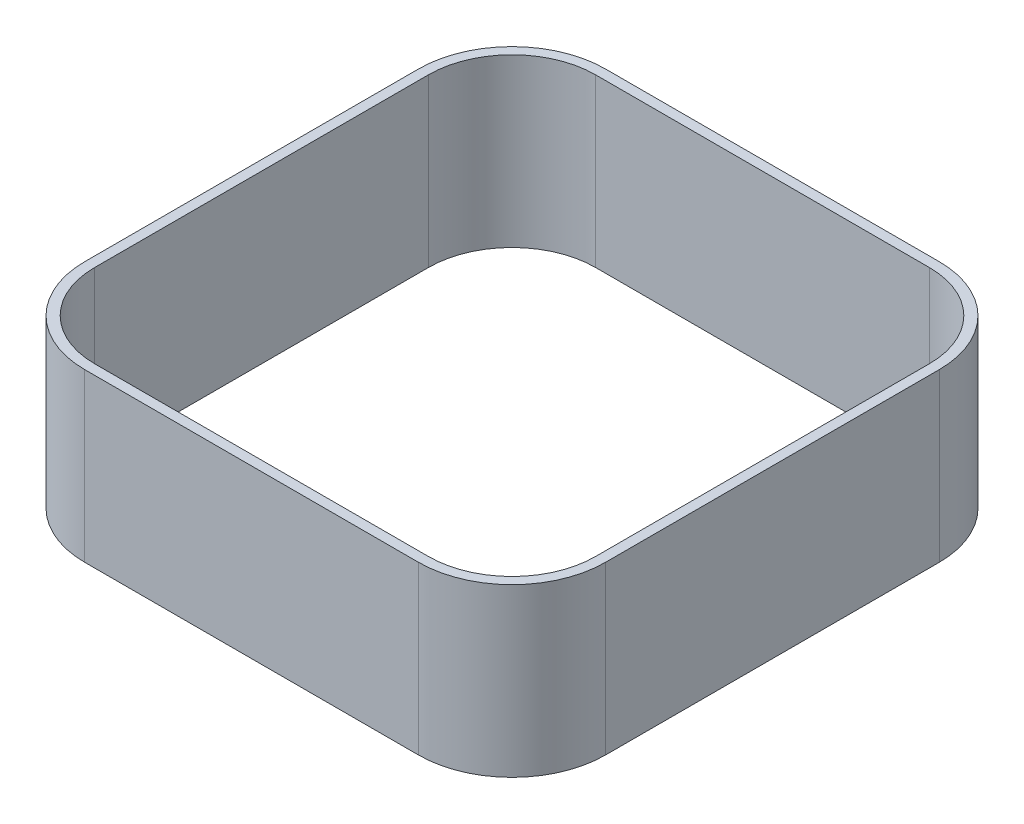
ISO-10303-21;
HEADER;
FILE_DESCRIPTION(('STEP AP214'),'2;1');
FILE_NAME('part.step','',(''),(''),'','','');
FILE_SCHEMA(('AUTOMOTIVE_DESIGN { 1 0 10303 214 1 1 1 1 }'));
ENDSEC;
DATA;
#1=APPLICATION_CONTEXT('core data for automotive mechanical design processes');
#2=APPLICATION_PROTOCOL_DEFINITION('international standard','automotive_design',2000,#1);
#3=PRODUCT_CONTEXT('',#1,'mechanical');
#4=PRODUCT('Part','Part','',(#3));
#5=PRODUCT_RELATED_PRODUCT_CATEGORY('part','',(#4));
#6=PRODUCT_DEFINITION_FORMATION('','',#4);
#7=PRODUCT_DEFINITION_CONTEXT('part definition',#1,'design');
#8=PRODUCT_DEFINITION('design','',#6,#7);
#9=PRODUCT_DEFINITION_SHAPE('','',#8);
#10=(LENGTH_UNIT() NAMED_UNIT(*) SI_UNIT(.MILLI.,.METRE.));
#11=(NAMED_UNIT(*) PLANE_ANGLE_UNIT() SI_UNIT($,.RADIAN.));
#12=(NAMED_UNIT(*) SI_UNIT($,.STERADIAN.) SOLID_ANGLE_UNIT());
#13=UNCERTAINTY_MEASURE_WITH_UNIT(LENGTH_MEASURE(1.E-05),#10,'distance_accuracy_value','');
#14=(GEOMETRIC_REPRESENTATION_CONTEXT(3) GLOBAL_UNCERTAINTY_ASSIGNED_CONTEXT((#13)) GLOBAL_UNIT_ASSIGNED_CONTEXT((#10,
#11,#12)) REPRESENTATION_CONTEXT('',''));
#15=CARTESIAN_POINT('',(0.,0.,0.));
#16=DIRECTION('',(0.,0.,1.));
#17=DIRECTION('',(1.,0.,0.));
#18=AXIS2_PLACEMENT_3D('',#15,#16,#17);
#19=CARTESIAN_POINT('',(-10.,10.,10.));
#20=DIRECTION('',(0.,-1.,0.));
#21=DIRECTION('',(0.,0.,-1.));
#22=AXIS2_PLACEMENT_3D('',#19,#20,#21);
#23=PLANE('',#22);
#24=CARTESIAN_POINT('',(-10.,10.,10.));
#25=DIRECTION('',(0.,1.,0.));
#26=DIRECTION('',(0.,0.,-1.));
#27=AXIS2_PLACEMENT_3D('',#24,#25,#26);
#28=CIRCLE('',#27,5.6);
#29=CARTESIAN_POINT('',(-15.6,10.,10.));
#30=VERTEX_POINT('',#29);
#31=CARTESIAN_POINT('',(-10.,10.,15.6));
#32=VERTEX_POINT('',#31);
#33=EDGE_CURVE('E211',#30,#32,#28,.T.);
#34=ORIENTED_EDGE('',*,*,#33,.T.);
#35=DIRECTION('',(1.,0.,0.));
#36=VECTOR('',#35,1.);
#37=CARTESIAN_POINT('',(-10.,10.,15.6));
#38=LINE('',#37,#36);
#39=CARTESIAN_POINT('',(10.,10.,15.6));
#40=VERTEX_POINT('',#39);
#41=EDGE_CURVE('E214',#32,#40,#38,.T.);
#42=ORIENTED_EDGE('',*,*,#41,.T.);
#43=CARTESIAN_POINT('',(10.,10.,10.));
#44=DIRECTION('',(0.,1.,0.));
#45=DIRECTION('',(0.,0.,1.));
#46=AXIS2_PLACEMENT_3D('',#43,#44,#45);
#47=CIRCLE('',#46,5.6);
#48=CARTESIAN_POINT('',(15.6,10.,10.));
#49=VERTEX_POINT('',#48);
#50=EDGE_CURVE('E217',#40,#49,#47,.T.);
#51=ORIENTED_EDGE('',*,*,#50,.T.);
#52=DIRECTION('',(0.,0.,-1.));
#53=VECTOR('',#52,1.);
#54=CARTESIAN_POINT('',(15.6,10.,10.));
#55=LINE('',#54,#53);
#56=CARTESIAN_POINT('',(15.6,10.,-10.));
#57=VERTEX_POINT('',#56);
#58=EDGE_CURVE('E219',#49,#57,#55,.T.);
#59=ORIENTED_EDGE('',*,*,#58,.T.);
#60=CARTESIAN_POINT('',(10.,10.,-10.));
#61=DIRECTION('',(0.,1.,0.));
#62=DIRECTION('',(0.,0.,-1.));
#63=AXIS2_PLACEMENT_3D('',#60,#61,#62);
#64=CIRCLE('',#63,5.6);
#65=CARTESIAN_POINT('',(10.,10.,-15.6));
#66=VERTEX_POINT('',#65);
#67=EDGE_CURVE('E221',#57,#66,#64,.T.);
#68=ORIENTED_EDGE('',*,*,#67,.T.);
#69=DIRECTION('',(-1.,0.,0.));
#70=VECTOR('',#69,1.);
#71=CARTESIAN_POINT('',(-10.,10.,-15.6));
#72=LINE('',#71,#70);
#73=CARTESIAN_POINT('',(-10.,10.,-15.6));
#74=VERTEX_POINT('',#73);
#75=EDGE_CURVE('E223',#66,#74,#72,.T.);
#76=ORIENTED_EDGE('',*,*,#75,.T.);
#77=CARTESIAN_POINT('',(-10.,10.,-10.));
#78=DIRECTION('',(0.,1.,0.));
#79=DIRECTION('',(0.,0.,-1.));
#80=AXIS2_PLACEMENT_3D('',#77,#78,#79);
#81=CIRCLE('',#80,5.6);
#82=CARTESIAN_POINT('',(-15.6,10.,-10.));
#83=VERTEX_POINT('',#82);
#84=EDGE_CURVE('E225',#74,#83,#81,.T.);
#85=ORIENTED_EDGE('',*,*,#84,.T.);
#86=DIRECTION('',(0.,0.,1.));
#87=VECTOR('',#86,1.);
#88=CARTESIAN_POINT('',(-15.6,10.,10.));
#89=LINE('',#88,#87);
#90=EDGE_CURVE('E227',#83,#30,#89,.T.);
#91=ORIENTED_EDGE('',*,*,#90,.T.);
#92=EDGE_LOOP('',(#34,#42,#51,#59,#68,#76,#85,#91));
#93=FACE_BOUND('',#92,.T.);
#94=CARTESIAN_POINT('',(-10.,10.,10.));
#95=DIRECTION('',(0.,1.,0.));
#96=DIRECTION('',(0.,0.,-1.));
#97=AXIS2_PLACEMENT_3D('',#94,#95,#96);
#98=CIRCLE('',#97,5.);
#99=CARTESIAN_POINT('',(-15.,10.,10.));
#100=VERTEX_POINT('',#99);
#101=CARTESIAN_POINT('',(-10.,10.,15.));
#102=VERTEX_POINT('',#101);
#103=EDGE_CURVE('E146',#100,#102,#98,.T.);
#104=ORIENTED_EDGE('',*,*,#103,.F.);
#105=DIRECTION('',(0.,0.,1.));
#106=VECTOR('',#105,1.);
#107=CARTESIAN_POINT('',(-15.,10.,10.));
#108=LINE('',#107,#106);
#109=CARTESIAN_POINT('',(-15.,10.,-10.));
#110=VERTEX_POINT('',#109);
#111=EDGE_CURVE('E179',#110,#100,#108,.T.);
#112=ORIENTED_EDGE('',*,*,#111,.F.);
#113=CARTESIAN_POINT('',(-10.,10.,-10.));
#114=DIRECTION('',(0.,1.,0.));
#115=DIRECTION('',(0.,0.,-1.));
#116=AXIS2_PLACEMENT_3D('',#113,#114,#115);
#117=CIRCLE('',#116,5.);
#118=CARTESIAN_POINT('',(-10.,10.,-15.));
#119=VERTEX_POINT('',#118);
#120=EDGE_CURVE('E177',#119,#110,#117,.T.);
#121=ORIENTED_EDGE('',*,*,#120,.F.);
#122=DIRECTION('',(-1.,0.,0.));
#123=VECTOR('',#122,1.);
#124=CARTESIAN_POINT('',(-10.,10.,-15.));
#125=LINE('',#124,#123);
#126=CARTESIAN_POINT('',(10.,10.,-15.));
#127=VERTEX_POINT('',#126);
#128=EDGE_CURVE('E175',#127,#119,#125,.T.);
#129=ORIENTED_EDGE('',*,*,#128,.F.);
#130=CARTESIAN_POINT('',(10.,10.,-10.));
#131=DIRECTION('',(0.,1.,0.));
#132=DIRECTION('',(0.,0.,-1.));
#133=AXIS2_PLACEMENT_3D('',#130,#131,#132);
#134=CIRCLE('',#133,5.);
#135=CARTESIAN_POINT('',(15.,10.,-10.));
#136=VERTEX_POINT('',#135);
#137=EDGE_CURVE('E173',#136,#127,#134,.T.);
#138=ORIENTED_EDGE('',*,*,#137,.F.);
#139=DIRECTION('',(0.,0.,-1.));
#140=VECTOR('',#139,1.);
#141=CARTESIAN_POINT('',(15.,10.,10.));
#142=LINE('',#141,#140);
#143=CARTESIAN_POINT('',(15.,10.,10.));
#144=VERTEX_POINT('',#143);
#145=EDGE_CURVE('E169',#144,#136,#142,.T.);
#146=ORIENTED_EDGE('',*,*,#145,.F.);
#147=CARTESIAN_POINT('',(10.,10.,10.));
#148=DIRECTION('',(0.,1.,0.));
#149=DIRECTION('',(0.,0.,1.));
#150=AXIS2_PLACEMENT_3D('',#147,#148,#149);
#151=CIRCLE('',#150,5.);
#152=CARTESIAN_POINT('',(10.,10.,15.));
#153=VERTEX_POINT('',#152);
#154=EDGE_CURVE('E167',#153,#144,#151,.T.);
#155=ORIENTED_EDGE('',*,*,#154,.F.);
#156=DIRECTION('',(1.,0.,0.));
#157=VECTOR('',#156,1.);
#158=CARTESIAN_POINT('',(-10.,10.,15.));
#159=LINE('',#158,#157);
#160=EDGE_CURVE('E154',#102,#153,#159,.T.);
#161=ORIENTED_EDGE('',*,*,#160,.F.);
#162=EDGE_LOOP('',(#104,#112,#121,#129,#138,#146,#155,#161));
#163=FACE_BOUND('',#162,.T.);
#164=ADVANCED_FACE('F33',(#93,#163),#23,.F.);
#165=CARTESIAN_POINT('',(-10.,0.,10.));
#166=DIRECTION('',(0.,-1.,0.));
#167=DIRECTION('',(0.,0.,-1.));
#168=AXIS2_PLACEMENT_3D('',#165,#166,#167);
#169=PLANE('',#168);
#170=CARTESIAN_POINT('',(-10.,0.,10.));
#171=DIRECTION('',(0.,1.,0.));
#172=DIRECTION('',(0.,0.,-1.));
#173=AXIS2_PLACEMENT_3D('',#170,#171,#172);
#174=CIRCLE('',#173,5.6);
#175=CARTESIAN_POINT('',(-15.6,0.,10.));
#176=VERTEX_POINT('',#175);
#177=CARTESIAN_POINT('',(-10.,0.,15.6));
#178=VERTEX_POINT('',#177);
#179=EDGE_CURVE('E162',#176,#178,#174,.T.);
#180=ORIENTED_EDGE('',*,*,#179,.F.);
#181=DIRECTION('',(0.,0.,1.));
#182=VECTOR('',#181,1.);
#183=CARTESIAN_POINT('',(-15.6,0.,10.));
#184=LINE('',#183,#182);
#185=CARTESIAN_POINT('',(-15.6,0.,-10.));
#186=VERTEX_POINT('',#185);
#187=EDGE_CURVE('E215',#186,#176,#184,.T.);
#188=ORIENTED_EDGE('',*,*,#187,.F.);
#189=CARTESIAN_POINT('',(-10.,0.,-10.));
#190=DIRECTION('',(0.,1.,0.));
#191=DIRECTION('',(0.,0.,-1.));
#192=AXIS2_PLACEMENT_3D('',#189,#190,#191);
#193=CIRCLE('',#192,5.6);
#194=CARTESIAN_POINT('',(-10.,0.,-15.6));
#195=VERTEX_POINT('',#194);
#196=EDGE_CURVE('E242',#195,#186,#193,.T.);
#197=ORIENTED_EDGE('',*,*,#196,.F.);
#198=DIRECTION('',(-1.,0.,0.));
#199=VECTOR('',#198,1.);
#200=CARTESIAN_POINT('',(-10.,0.,-15.6));
#201=LINE('',#200,#199);
#202=CARTESIAN_POINT('',(10.,0.,-15.6));
#203=VERTEX_POINT('',#202);
#204=EDGE_CURVE('E240',#203,#195,#201,.T.);
#205=ORIENTED_EDGE('',*,*,#204,.F.);
#206=CARTESIAN_POINT('',(10.,0.,-10.));
#207=DIRECTION('',(0.,1.,0.));
#208=DIRECTION('',(0.,0.,-1.));
#209=AXIS2_PLACEMENT_3D('',#206,#207,#208);
#210=CIRCLE('',#209,5.6);
#211=CARTESIAN_POINT('',(15.6,0.,-10.));
#212=VERTEX_POINT('',#211);
#213=EDGE_CURVE('E238',#212,#203,#210,.T.);
#214=ORIENTED_EDGE('',*,*,#213,.F.);
#215=DIRECTION('',(0.,0.,-1.));
#216=VECTOR('',#215,1.);
#217=CARTESIAN_POINT('',(15.6,0.,10.));
#218=LINE('',#217,#216);
#219=CARTESIAN_POINT('',(15.6,0.,10.));
#220=VERTEX_POINT('',#219);
#221=EDGE_CURVE('E236',#220,#212,#218,.T.);
#222=ORIENTED_EDGE('',*,*,#221,.F.);
#223=CARTESIAN_POINT('',(10.,0.,10.));
#224=DIRECTION('',(0.,1.,0.));
#225=DIRECTION('',(0.,0.,1.));
#226=AXIS2_PLACEMENT_3D('',#223,#224,#225);
#227=CIRCLE('',#226,5.6);
#228=CARTESIAN_POINT('',(10.,0.,15.6));
#229=VERTEX_POINT('',#228);
#230=EDGE_CURVE('E234',#229,#220,#227,.T.);
#231=ORIENTED_EDGE('',*,*,#230,.F.);
#232=DIRECTION('',(1.,0.,0.));
#233=VECTOR('',#232,1.);
#234=CARTESIAN_POINT('',(-10.,0.,15.6));
#235=LINE('',#234,#233);
#236=EDGE_CURVE('E232',#178,#229,#235,.T.);
#237=ORIENTED_EDGE('',*,*,#236,.F.);
#238=EDGE_LOOP('',(#180,#188,#197,#205,#214,#222,#231,#237));
#239=FACE_BOUND('',#238,.T.);
#240=DIRECTION('',(0.,0.,1.));
#241=VECTOR('',#240,1.);
#242=CARTESIAN_POINT('',(-15.,0.,10.));
#243=LINE('',#242,#241);
#244=CARTESIAN_POINT('',(-15.,0.,-10.));
#245=VERTEX_POINT('',#244);
#246=CARTESIAN_POINT('',(-15.,0.,10.));
#247=VERTEX_POINT('',#246);
#248=EDGE_CURVE('E155',#245,#247,#243,.T.);
#249=ORIENTED_EDGE('',*,*,#248,.T.);
#250=CARTESIAN_POINT('',(-10.,0.,10.));
#251=DIRECTION('',(0.,1.,0.));
#252=DIRECTION('',(0.,0.,-1.));
#253=AXIS2_PLACEMENT_3D('',#250,#251,#252);
#254=CIRCLE('',#253,5.);
#255=CARTESIAN_POINT('',(-10.,0.,15.));
#256=VERTEX_POINT('',#255);
#257=EDGE_CURVE('E56',#247,#256,#254,.T.);
#258=ORIENTED_EDGE('',*,*,#257,.T.);
#259=DIRECTION('',(1.,0.,0.));
#260=VECTOR('',#259,1.);
#261=CARTESIAN_POINT('',(-10.,0.,15.));
#262=LINE('',#261,#260);
#263=CARTESIAN_POINT('',(10.,0.,15.));
#264=VERTEX_POINT('',#263);
#265=EDGE_CURVE('E161',#256,#264,#262,.T.);
#266=ORIENTED_EDGE('',*,*,#265,.T.);
#267=CARTESIAN_POINT('',(10.,0.,10.));
#268=DIRECTION('',(0.,1.,0.));
#269=DIRECTION('',(0.,0.,1.));
#270=AXIS2_PLACEMENT_3D('',#267,#268,#269);
#271=CIRCLE('',#270,5.);
#272=CARTESIAN_POINT('',(15.,0.,10.));
#273=VERTEX_POINT('',#272);
#274=EDGE_CURVE('E183',#264,#273,#271,.T.);
#275=ORIENTED_EDGE('',*,*,#274,.T.);
#276=DIRECTION('',(0.,0.,-1.));
#277=VECTOR('',#276,1.);
#278=CARTESIAN_POINT('',(15.,0.,10.));
#279=LINE('',#278,#277);
#280=CARTESIAN_POINT('',(15.,0.,-10.));
#281=VERTEX_POINT('',#280);
#282=EDGE_CURVE('E186',#273,#281,#279,.T.);
#283=ORIENTED_EDGE('',*,*,#282,.T.);
#284=CARTESIAN_POINT('',(10.,0.,-10.));
#285=DIRECTION('',(0.,1.,0.));
#286=DIRECTION('',(0.,0.,-1.));
#287=AXIS2_PLACEMENT_3D('',#284,#285,#286);
#288=CIRCLE('',#287,5.);
#289=CARTESIAN_POINT('',(10.,0.,-15.));
#290=VERTEX_POINT('',#289);
#291=EDGE_CURVE('E189',#281,#290,#288,.T.);
#292=ORIENTED_EDGE('',*,*,#291,.T.);
#293=DIRECTION('',(-1.,0.,0.));
#294=VECTOR('',#293,1.);
#295=CARTESIAN_POINT('',(-10.,0.,-15.));
#296=LINE('',#295,#294);
#297=CARTESIAN_POINT('',(-10.,0.,-15.));
#298=VERTEX_POINT('',#297);
#299=EDGE_CURVE('E192',#290,#298,#296,.T.);
#300=ORIENTED_EDGE('',*,*,#299,.T.);
#301=CARTESIAN_POINT('',(-10.,0.,-10.));
#302=DIRECTION('',(0.,1.,0.));
#303=DIRECTION('',(0.,0.,-1.));
#304=AXIS2_PLACEMENT_3D('',#301,#302,#303);
#305=CIRCLE('',#304,5.);
#306=EDGE_CURVE('E195',#298,#245,#305,.T.);
#307=ORIENTED_EDGE('',*,*,#306,.T.);
#308=EDGE_LOOP('',(#249,#258,#266,#275,#283,#292,#300,#307));
#309=FACE_BOUND('',#308,.T.);
#310=ADVANCED_FACE('F272',(#239,#309),#169,.T.);
#311=CARTESIAN_POINT('',(-10.,10.,10.));
#312=DIRECTION('',(0.,-1.,0.));
#313=DIRECTION('',(0.,0.,-1.));
#314=AXIS2_PLACEMENT_3D('',#311,#312,#313);
#315=CYLINDRICAL_SURFACE('',#314,5.6);
#316=ORIENTED_EDGE('',*,*,#179,.T.);
#317=DIRECTION('',(0.,-1.,0.));
#318=VECTOR('',#317,1.);
#319=CARTESIAN_POINT('',(-10.,10.,15.6));
#320=LINE('',#319,#318);
#321=EDGE_CURVE('E11',#32,#178,#320,.T.);
#322=ORIENTED_EDGE('',*,*,#321,.F.);
#323=ORIENTED_EDGE('',*,*,#33,.F.);
#324=DIRECTION('',(0.,-1.,0.));
#325=VECTOR('',#324,1.);
#326=CARTESIAN_POINT('',(-15.6,10.,10.));
#327=LINE('',#326,#325);
#328=EDGE_CURVE('E229',#30,#176,#327,.T.);
#329=ORIENTED_EDGE('',*,*,#328,.T.);
#330=EDGE_LOOP('',(#316,#322,#323,#329));
#331=FACE_BOUND('',#330,.T.);
#332=ADVANCED_FACE('F35',(#331),#315,.T.);
#333=CARTESIAN_POINT('',(-10.,10.,15.6));
#334=DIRECTION('',(0.,0.,-1.));
#335=DIRECTION('',(-1.,0.,0.));
#336=AXIS2_PLACEMENT_3D('',#333,#334,#335);
#337=PLANE('',#336);
#338=ORIENTED_EDGE('',*,*,#236,.T.);
#339=DIRECTION('',(0.,-1.,0.));
#340=VECTOR('',#339,1.);
#341=CARTESIAN_POINT('',(10.,10.,15.6));
#342=LINE('',#341,#340);
#343=EDGE_CURVE('E41',#40,#229,#342,.T.);
#344=ORIENTED_EDGE('',*,*,#343,.F.);
#345=ORIENTED_EDGE('',*,*,#41,.F.);
#346=ORIENTED_EDGE('',*,*,#321,.T.);
#347=EDGE_LOOP('',(#338,#344,#345,#346));
#348=FACE_BOUND('',#347,.T.);
#349=ADVANCED_FACE('F289',(#348),#337,.F.);
#350=CARTESIAN_POINT('',(10.,10.,10.));
#351=DIRECTION('',(0.,-1.,0.));
#352=DIRECTION('',(0.,0.,-1.));
#353=AXIS2_PLACEMENT_3D('',#350,#351,#352);
#354=CYLINDRICAL_SURFACE('',#353,5.6);
#355=ORIENTED_EDGE('',*,*,#230,.T.);
#356=DIRECTION('',(0.,-1.,0.));
#357=VECTOR('',#356,1.);
#358=CARTESIAN_POINT('',(15.6,10.,10.));
#359=LINE('',#358,#357);
#360=EDGE_CURVE('E259',#49,#220,#359,.T.);
#361=ORIENTED_EDGE('',*,*,#360,.F.);
#362=ORIENTED_EDGE('',*,*,#50,.F.);
#363=ORIENTED_EDGE('',*,*,#343,.T.);
#364=EDGE_LOOP('',(#355,#361,#362,#363));
#365=FACE_BOUND('',#364,.T.);
#366=ADVANCED_FACE('F266',(#365),#354,.T.);
#367=CARTESIAN_POINT('',(15.6,10.,10.));
#368=DIRECTION('',(-1.,0.,0.));
#369=DIRECTION('',(0.,0.,1.));
#370=AXIS2_PLACEMENT_3D('',#367,#368,#369);
#371=PLANE('',#370);
#372=ORIENTED_EDGE('',*,*,#221,.T.);
#373=DIRECTION('',(0.,-1.,0.));
#374=VECTOR('',#373,1.);
#375=CARTESIAN_POINT('',(15.6,10.,-10.));
#376=LINE('',#375,#374);
#377=EDGE_CURVE('E256',#57,#212,#376,.T.);
#378=ORIENTED_EDGE('',*,*,#377,.F.);
#379=ORIENTED_EDGE('',*,*,#58,.F.);
#380=ORIENTED_EDGE('',*,*,#360,.T.);
#381=EDGE_LOOP('',(#372,#378,#379,#380));
#382=FACE_BOUND('',#381,.T.);
#383=ADVANCED_FACE('F278',(#382),#371,.F.);
#384=CARTESIAN_POINT('',(10.,10.,-10.));
#385=DIRECTION('',(0.,-1.,0.));
#386=DIRECTION('',(0.,0.,-1.));
#387=AXIS2_PLACEMENT_3D('',#384,#385,#386);
#388=CYLINDRICAL_SURFACE('',#387,5.6);
#389=ORIENTED_EDGE('',*,*,#213,.T.);
#390=DIRECTION('',(0.,-1.,0.));
#391=VECTOR('',#390,1.);
#392=CARTESIAN_POINT('',(10.,10.,-15.6));
#393=LINE('',#392,#391);
#394=EDGE_CURVE('E253',#66,#203,#393,.T.);
#395=ORIENTED_EDGE('',*,*,#394,.F.);
#396=ORIENTED_EDGE('',*,*,#67,.F.);
#397=ORIENTED_EDGE('',*,*,#377,.T.);
#398=EDGE_LOOP('',(#389,#395,#396,#397));
#399=FACE_BOUND('',#398,.T.);
#400=ADVANCED_FACE('F282',(#399),#388,.T.);
#401=CARTESIAN_POINT('',(-10.,10.,-15.6));
#402=DIRECTION('',(0.,0.,1.));
#403=DIRECTION('',(1.,0.,0.));
#404=AXIS2_PLACEMENT_3D('',#401,#402,#403);
#405=PLANE('',#404);
#406=ORIENTED_EDGE('',*,*,#204,.T.);
#407=DIRECTION('',(0.,-1.,0.));
#408=VECTOR('',#407,1.);
#409=CARTESIAN_POINT('',(-10.,10.,-15.6));
#410=LINE('',#409,#408);
#411=EDGE_CURVE('E250',#74,#195,#410,.T.);
#412=ORIENTED_EDGE('',*,*,#411,.F.);
#413=ORIENTED_EDGE('',*,*,#75,.F.);
#414=ORIENTED_EDGE('',*,*,#394,.T.);
#415=EDGE_LOOP('',(#406,#412,#413,#414));
#416=FACE_BOUND('',#415,.T.);
#417=ADVANCED_FACE('F302',(#416),#405,.F.);
#418=CARTESIAN_POINT('',(-10.,10.,-10.));
#419=DIRECTION('',(0.,-1.,0.));
#420=DIRECTION('',(0.,0.,-1.));
#421=AXIS2_PLACEMENT_3D('',#418,#419,#420);
#422=CYLINDRICAL_SURFACE('',#421,5.6);
#423=ORIENTED_EDGE('',*,*,#196,.T.);
#424=DIRECTION('',(0.,-1.,0.));
#425=VECTOR('',#424,1.);
#426=CARTESIAN_POINT('',(-15.6,10.,-10.));
#427=LINE('',#426,#425);
#428=EDGE_CURVE('E247',#83,#186,#427,.T.);
#429=ORIENTED_EDGE('',*,*,#428,.F.);
#430=ORIENTED_EDGE('',*,*,#84,.F.);
#431=ORIENTED_EDGE('',*,*,#411,.T.);
#432=EDGE_LOOP('',(#423,#429,#430,#431));
#433=FACE_BOUND('',#432,.T.);
#434=ADVANCED_FACE('F300',(#433),#422,.T.);
#435=CARTESIAN_POINT('',(-15.6,10.,10.));
#436=DIRECTION('',(1.,0.,0.));
#437=DIRECTION('',(0.,0.,-1.));
#438=AXIS2_PLACEMENT_3D('',#435,#436,#437);
#439=PLANE('',#438);
#440=ORIENTED_EDGE('',*,*,#187,.T.);
#441=ORIENTED_EDGE('',*,*,#328,.F.);
#442=ORIENTED_EDGE('',*,*,#90,.F.);
#443=ORIENTED_EDGE('',*,*,#428,.T.);
#444=EDGE_LOOP('',(#440,#441,#442,#443));
#445=FACE_BOUND('',#444,.T.);
#446=ADVANCED_FACE('F295',(#445),#439,.F.);
#447=CARTESIAN_POINT('',(-10.,10.,10.));
#448=DIRECTION('',(0.,-1.,0.));
#449=DIRECTION('',(0.,0.,-1.));
#450=AXIS2_PLACEMENT_3D('',#447,#448,#449);
#451=CYLINDRICAL_SURFACE('',#450,5.);
#452=ORIENTED_EDGE('',*,*,#257,.F.);
#453=DIRECTION('',(0.,-1.,0.));
#454=VECTOR('',#453,1.);
#455=CARTESIAN_POINT('',(-15.,10.,10.));
#456=LINE('',#455,#454);
#457=EDGE_CURVE('E150',#100,#247,#456,.T.);
#458=ORIENTED_EDGE('',*,*,#457,.F.);
#459=ORIENTED_EDGE('',*,*,#103,.T.);
#460=DIRECTION('',(0.,-1.,0.));
#461=VECTOR('',#460,1.);
#462=CARTESIAN_POINT('',(-10.,10.,15.));
#463=LINE('',#462,#461);
#464=EDGE_CURVE('E149',#102,#256,#463,.T.);
#465=ORIENTED_EDGE('',*,*,#464,.T.);
#466=EDGE_LOOP('',(#452,#458,#459,#465));
#467=FACE_BOUND('',#466,.T.);
#468=ADVANCED_FACE('F148',(#467),#451,.F.);
#469=CARTESIAN_POINT('',(-10.,10.,15.));
#470=DIRECTION('',(0.,0.,-1.));
#471=DIRECTION('',(-1.,0.,0.));
#472=AXIS2_PLACEMENT_3D('',#469,#470,#471);
#473=PLANE('',#472);
#474=ORIENTED_EDGE('',*,*,#265,.F.);
#475=ORIENTED_EDGE('',*,*,#464,.F.);
#476=ORIENTED_EDGE('',*,*,#160,.T.);
#477=DIRECTION('',(0.,-1.,0.));
#478=VECTOR('',#477,1.);
#479=CARTESIAN_POINT('',(10.,10.,15.));
#480=LINE('',#479,#478);
#481=EDGE_CURVE('E163',#153,#264,#480,.T.);
#482=ORIENTED_EDGE('',*,*,#481,.T.);
#483=EDGE_LOOP('',(#474,#475,#476,#482));
#484=FACE_BOUND('',#483,.T.);
#485=ADVANCED_FACE('F158',(#484),#473,.T.);
#486=CARTESIAN_POINT('',(10.,10.,10.));
#487=DIRECTION('',(0.,-1.,0.));
#488=DIRECTION('',(0.,0.,-1.));
#489=AXIS2_PLACEMENT_3D('',#486,#487,#488);
#490=CYLINDRICAL_SURFACE('',#489,5.);
#491=ORIENTED_EDGE('',*,*,#274,.F.);
#492=ORIENTED_EDGE('',*,*,#481,.F.);
#493=ORIENTED_EDGE('',*,*,#154,.T.);
#494=DIRECTION('',(0.,-1.,0.));
#495=VECTOR('',#494,1.);
#496=CARTESIAN_POINT('',(15.,10.,10.));
#497=LINE('',#496,#495);
#498=EDGE_CURVE('E208',#144,#273,#497,.T.);
#499=ORIENTED_EDGE('',*,*,#498,.T.);
#500=EDGE_LOOP('',(#491,#492,#493,#499));
#501=FACE_BOUND('',#500,.T.);
#502=ADVANCED_FACE('F327',(#501),#490,.F.);
#503=CARTESIAN_POINT('',(15.,10.,10.));
#504=DIRECTION('',(-1.,0.,0.));
#505=DIRECTION('',(0.,0.,1.));
#506=AXIS2_PLACEMENT_3D('',#503,#504,#505);
#507=PLANE('',#506);
#508=ORIENTED_EDGE('',*,*,#282,.F.);
#509=ORIENTED_EDGE('',*,*,#498,.F.);
#510=ORIENTED_EDGE('',*,*,#145,.T.);
#511=DIRECTION('',(0.,-1.,0.));
#512=VECTOR('',#511,1.);
#513=CARTESIAN_POINT('',(15.,10.,-10.));
#514=LINE('',#513,#512);
#515=EDGE_CURVE('E206',#136,#281,#514,.T.);
#516=ORIENTED_EDGE('',*,*,#515,.T.);
#517=EDGE_LOOP('',(#508,#509,#510,#516));
#518=FACE_BOUND('',#517,.T.);
#519=ADVANCED_FACE('F331',(#518),#507,.T.);
#520=CARTESIAN_POINT('',(10.,10.,-10.));
#521=DIRECTION('',(0.,-1.,0.));
#522=DIRECTION('',(0.,0.,-1.));
#523=AXIS2_PLACEMENT_3D('',#520,#521,#522);
#524=CYLINDRICAL_SURFACE('',#523,5.);
#525=ORIENTED_EDGE('',*,*,#291,.F.);
#526=ORIENTED_EDGE('',*,*,#515,.F.);
#527=ORIENTED_EDGE('',*,*,#137,.T.);
#528=DIRECTION('',(0.,-1.,0.));
#529=VECTOR('',#528,1.);
#530=CARTESIAN_POINT('',(10.,10.,-15.));
#531=LINE('',#530,#529);
#532=EDGE_CURVE('E204',#127,#290,#531,.T.);
#533=ORIENTED_EDGE('',*,*,#532,.T.);
#534=EDGE_LOOP('',(#525,#526,#527,#533));
#535=FACE_BOUND('',#534,.T.);
#536=ADVANCED_FACE('F337',(#535),#524,.F.);
#537=CARTESIAN_POINT('',(-10.,10.,-15.));
#538=DIRECTION('',(0.,0.,1.));
#539=DIRECTION('',(1.,0.,0.));
#540=AXIS2_PLACEMENT_3D('',#537,#538,#539);
#541=PLANE('',#540);
#542=ORIENTED_EDGE('',*,*,#299,.F.);
#543=ORIENTED_EDGE('',*,*,#532,.F.);
#544=ORIENTED_EDGE('',*,*,#128,.T.);
#545=DIRECTION('',(0.,-1.,0.));
#546=VECTOR('',#545,1.);
#547=CARTESIAN_POINT('',(-10.,10.,-15.));
#548=LINE('',#547,#546);
#549=EDGE_CURVE('E202',#119,#298,#548,.T.);
#550=ORIENTED_EDGE('',*,*,#549,.T.);
#551=EDGE_LOOP('',(#542,#543,#544,#550));
#552=FACE_BOUND('',#551,.T.);
#553=ADVANCED_FACE('F341',(#552),#541,.T.);
#554=CARTESIAN_POINT('',(-10.,10.,-10.));
#555=DIRECTION('',(0.,-1.,0.));
#556=DIRECTION('',(0.,0.,-1.));
#557=AXIS2_PLACEMENT_3D('',#554,#555,#556);
#558=CYLINDRICAL_SURFACE('',#557,5.);
#559=ORIENTED_EDGE('',*,*,#306,.F.);
#560=ORIENTED_EDGE('',*,*,#549,.F.);
#561=ORIENTED_EDGE('',*,*,#120,.T.);
#562=DIRECTION('',(0.,-1.,0.));
#563=VECTOR('',#562,1.);
#564=CARTESIAN_POINT('',(-15.,10.,-10.));
#565=LINE('',#564,#563);
#566=EDGE_CURVE('E48',#110,#245,#565,.T.);
#567=ORIENTED_EDGE('',*,*,#566,.T.);
#568=EDGE_LOOP('',(#559,#560,#561,#567));
#569=FACE_BOUND('',#568,.T.);
#570=ADVANCED_FACE('F345',(#569),#558,.F.);
#571=CARTESIAN_POINT('',(-15.,10.,10.));
#572=DIRECTION('',(1.,0.,0.));
#573=DIRECTION('',(0.,0.,-1.));
#574=AXIS2_PLACEMENT_3D('',#571,#572,#573);
#575=PLANE('',#574);
#576=ORIENTED_EDGE('',*,*,#248,.F.);
#577=ORIENTED_EDGE('',*,*,#566,.F.);
#578=ORIENTED_EDGE('',*,*,#111,.T.);
#579=ORIENTED_EDGE('',*,*,#457,.T.);
#580=EDGE_LOOP('',(#576,#577,#578,#579));
#581=FACE_BOUND('',#580,.T.);
#582=ADVANCED_FACE('F349',(#581),#575,.T.);
#583=CLOSED_SHELL('',(#164,#310,#332,#349,#366,#383,#400,#417,#434,#446,#468,#485,#502,#519,
#536,#553,#570,#582));
#584=MANIFOLD_SOLID_BREP('B2',#583);
#585=ADVANCED_BREP_SHAPE_REPRESENTATION('',(#18,#584),#14);
#586=SHAPE_DEFINITION_REPRESENTATION(#9,#585);
ENDSEC;
END-ISO-10303-21;
